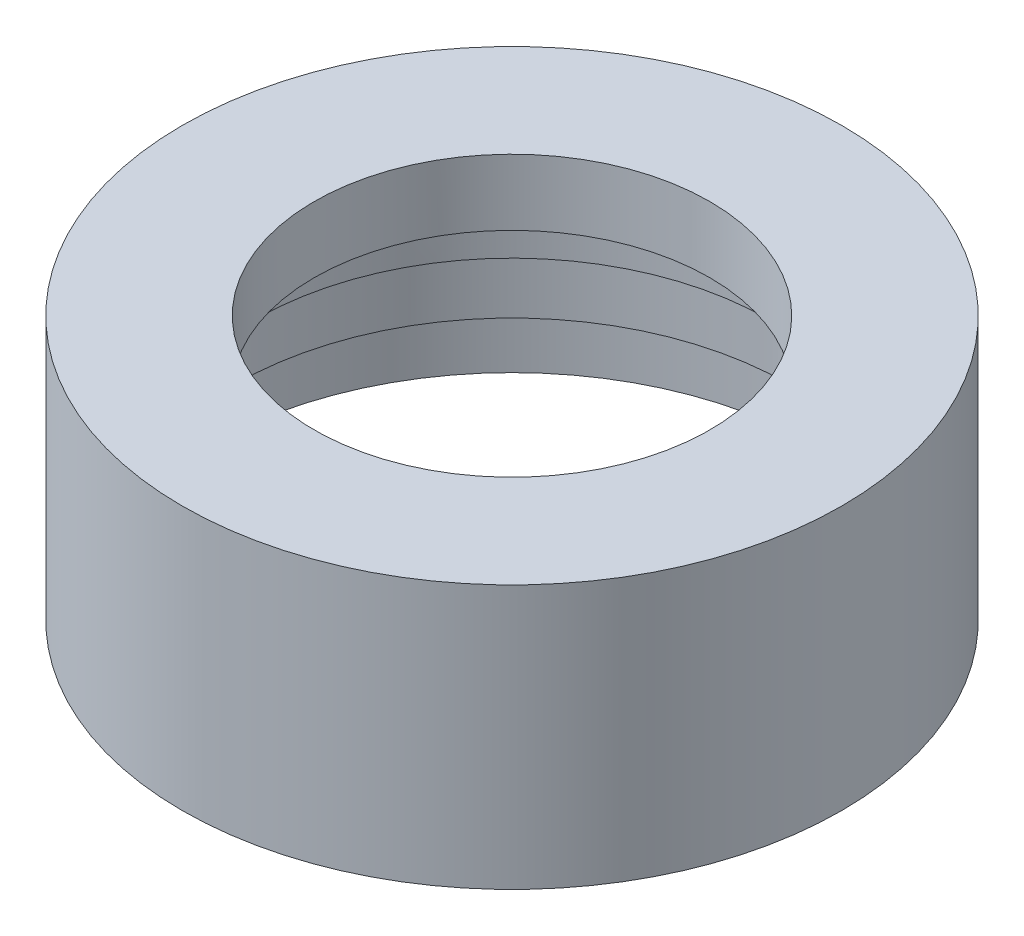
ISO-10303-21;
HEADER;
FILE_DESCRIPTION(('STEP AP214'),'2;1');
FILE_NAME('part.step','',(''),(''),'','','');
FILE_SCHEMA(('AUTOMOTIVE_DESIGN { 1 0 10303 214 1 1 1 1 }'));
ENDSEC;
DATA;
#1=APPLICATION_CONTEXT('core data for automotive mechanical design processes');
#2=APPLICATION_PROTOCOL_DEFINITION('international standard','automotive_design',2000,#1);
#3=PRODUCT_CONTEXT('',#1,'mechanical');
#4=PRODUCT('Part','Part','',(#3));
#5=PRODUCT_RELATED_PRODUCT_CATEGORY('part','',(#4));
#6=PRODUCT_DEFINITION_FORMATION('','',#4);
#7=PRODUCT_DEFINITION_CONTEXT('part definition',#1,'design');
#8=PRODUCT_DEFINITION('design','',#6,#7);
#9=PRODUCT_DEFINITION_SHAPE('','',#8);
#10=(LENGTH_UNIT() NAMED_UNIT(*) SI_UNIT(.MILLI.,.METRE.));
#11=(NAMED_UNIT(*) PLANE_ANGLE_UNIT() SI_UNIT($,.RADIAN.));
#12=(NAMED_UNIT(*) SI_UNIT($,.STERADIAN.) SOLID_ANGLE_UNIT());
#13=UNCERTAINTY_MEASURE_WITH_UNIT(LENGTH_MEASURE(1.E-05),#10,'distance_accuracy_value','');
#14=(GEOMETRIC_REPRESENTATION_CONTEXT(3) GLOBAL_UNCERTAINTY_ASSIGNED_CONTEXT((#13)) GLOBAL_UNIT_ASSIGNED_CONTEXT((#10,
#11,#12)) REPRESENTATION_CONTEXT('',''));
#15=CARTESIAN_POINT('',(0.,0.,0.));
#16=DIRECTION('',(0.,0.,1.));
#17=DIRECTION('',(1.,0.,0.));
#18=AXIS2_PLACEMENT_3D('',#15,#16,#17);
#19=CARTESIAN_POINT('',(-105.783467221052,-140.846893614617,0.));
#20=DIRECTION('',(0.,-1.,0.));
#21=DIRECTION('',(-1.00000000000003,0.,0.));
#22=AXIS2_PLACEMENT_3D('',#19,#20,#21);
#23=SPHERICAL_SURFACE('',#22,151.358167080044);
#24=CARTESIAN_POINT('',(-105.783467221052,8.48300497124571,0.));
#25=DIRECTION('',(0.,-1.,0.));
#26=DIRECTION('',(0.,0.,-1.00000000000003));
#27=AXIS2_PLACEMENT_3D('',#24,#25,#26);
#28=CIRCLE('',#27,24.6956702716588);
#29=CARTESIAN_POINT('',(-130.479137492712,8.48300497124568,0.));
#30=VERTEX_POINT('',#29);
#31=EDGE_CURVE('E68',#30,#30,#28,.T.);
#32=CARTESIAN_POINT('',(-105.783467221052,9.30766756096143,0.));
#33=DIRECTION('',(0.,-1.,0.));
#34=DIRECTION('',(0.,0.,-1.00000000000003));
#35=AXIS2_PLACEMENT_3D('',#32,#33,#34);
#36=CIRCLE('',#35,19.05);
#37=CARTESIAN_POINT('',(-124.833467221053,9.30766756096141,0.));
#38=VERTEX_POINT('',#37);
#39=EDGE_CURVE('E10',#38,#38,#36,.T.);
#40=CARTESIAN_POINT('',(-130.479137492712,8.48300497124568,0.));
#41=CARTESIAN_POINT('',(-130.420497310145,8.49270268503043,0.));
#42=CARTESIAN_POINT('',(-130.361851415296,8.50236585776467,0.));
#43=CARTESIAN_POINT('',(-130.24454828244,8.52162310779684,0.));
#44=CARTESIAN_POINT('',(-130.185891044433,8.53121718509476,0.));
#45=CARTESIAN_POINT('',(-130.068565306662,8.55033623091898,0.));
#46=CARTESIAN_POINT('',(-130.009896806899,8.55986119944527,0.));
#47=CARTESIAN_POINT('',(-129.892548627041,8.57884201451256,0.));
#48=CARTESIAN_POINT('',(-129.833868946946,8.58829786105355,0.));
#49=CARTESIAN_POINT('',(-129.716498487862,8.60714041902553,0.));
#50=CARTESIAN_POINT('',(-129.657807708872,8.61652713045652,0.));
#51=CARTESIAN_POINT('',(-129.540415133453,8.63523140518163,0.));
#52=CARTESIAN_POINT('',(-129.481713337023,8.64454896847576,0.));
#53=CARTESIAN_POINT('',(-129.36429880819,8.66311493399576,0.));
#54=CARTESIAN_POINT('',(-129.305586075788,8.67236333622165,0.));
#55=CARTESIAN_POINT('',(-129.188149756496,8.69079096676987,0.));
#56=CARTESIAN_POINT('',(-129.129426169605,8.6999701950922,0.));
#57=CARTESIAN_POINT('',(-129.011968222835,8.71825946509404,0.));
#58=CARTESIAN_POINT('',(-128.953233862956,8.72736950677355,0.));
#59=CARTESIAN_POINT('',(-128.835754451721,8.74552039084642,0.));
#60=CARTESIAN_POINT('',(-128.777009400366,8.7545612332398,0.));
#61=CARTESIAN_POINT('',(-128.65950868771,8.77257370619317,0.));
#62=CARTESIAN_POINT('',(-128.600753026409,8.78154533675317,0.));
#63=CARTESIAN_POINT('',(-128.483231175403,8.7994193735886,0.));
#64=CARTESIAN_POINT('',(-128.424464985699,8.80832177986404,0.));
#65=CARTESIAN_POINT('',(-128.306922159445,8.82605735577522,0.));
#66=CARTESIAN_POINT('',(-128.248145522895,8.83489052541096,0.));
#67=CARTESIAN_POINT('',(-128.130581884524,8.85248761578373,0.));
#68=CARTESIAN_POINT('',(-128.071794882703,8.86125153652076,0.));
#69=CARTESIAN_POINT('',(-127.954210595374,8.87871011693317,0.));
#70=CARTESIAN_POINT('',(-127.895413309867,8.88740477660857,0.));
#71=CARTESIAN_POINT('',(-127.777808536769,8.90472482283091,0.));
#72=CARTESIAN_POINT('',(-127.719001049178,8.91335020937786,0.));
#73=CARTESIAN_POINT('',(-127.601375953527,8.93053169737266,0.));
#74=CARTESIAN_POINT('',(-127.542558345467,8.93908779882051,0.));
#75=CARTESIAN_POINT('',(-127.424913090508,8.95613070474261,0.));
#76=CARTESIAN_POINT('',(-127.366085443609,8.96461750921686,0.));
#77=CARTESIAN_POINT('',(-127.248420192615,8.9815218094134,0.));
#78=CARTESIAN_POINT('',(-127.18958258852,8.9899393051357,0.));
#79=CARTESIAN_POINT('',(-127.071897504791,9.00670497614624,0.));
#80=CARTESIAN_POINT('',(-127.013050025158,9.01505315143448,0.));
#81=CARTESIAN_POINT('',(-126.895345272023,9.03168016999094,0.));
#82=CARTESIAN_POINT('',(-126.836487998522,9.03995901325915,0.));
#83=CARTESIAN_POINT('',(-126.718763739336,9.05644735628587,0.));
#84=CARTESIAN_POINT('',(-126.659896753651,9.06465685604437,0.));
#85=CARTESIAN_POINT('',(-126.542153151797,9.08100650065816,0.));
#86=CARTESIAN_POINT('',(-126.483276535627,9.08914664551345,0.));
#87=CARTESIAN_POINT('',(-126.365513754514,9.1053575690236,0.));
#88=CARTESIAN_POINT('',(-126.30662758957,9.11342834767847,0.));
#89=CARTESIAN_POINT('',(-126.188845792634,9.12950052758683,0.));
#90=CARTESIAN_POINT('',(-126.129950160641,9.13750192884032,0.));
#91=CARTESIAN_POINT('',(-126.012149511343,9.15343534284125,0.));
#92=CARTESIAN_POINT('',(-125.953244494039,9.16136735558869,0.));
#93=CARTESIAN_POINT('',(-125.835425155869,9.17716198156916,0.));
#94=CARTESIAN_POINT('',(-125.776510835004,9.18502459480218,0.));
#95=CARTESIAN_POINT('',(-125.658672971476,9.20068041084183,0.));
#96=CARTESIAN_POINT('',(-125.599749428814,9.20847361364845,0.));
#97=CARTESIAN_POINT('',(-125.481893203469,9.22399059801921,0.));
#98=CARTESIAN_POINT('',(-125.422960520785,9.23171437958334,0.));
#99=CARTESIAN_POINT('',(-125.305086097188,9.2470925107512,0.));
#100=CARTESIAN_POINT('',(-125.246144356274,9.25474686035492,0.));
#101=CARTESIAN_POINT('',(-125.128251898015,9.26998611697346,0.));
#102=CARTESIAN_POINT('',(-125.06930118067,9.27757102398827,0.));
#103=CARTESIAN_POINT('',(-124.951390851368,9.29267138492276,0.));
#104=CARTESIAN_POINT('',(-124.89243123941,9.30018683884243,0.));
#105=CARTESIAN_POINT('',(-124.833467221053,9.30766756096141,0.));
#106=B_SPLINE_CURVE_WITH_KNOTS('',3,(#40,#41,#42,#43,#44,#45,#46,#47,#48,#49,#50,#51,#52,#53,
#54,#55,#56,#57,#58,#59,#60,#61,#62,#63,#64,#65,#66,#67,#68,#69,#70,#71,#72,#73,#74,#75,#76,#77,
#78,#79,#80,#81,#82,#83,#84,#85,#86,#87,#88,#89,#90,#91,#92,#93,#94,#95,#96,#97,#98,#99,#100,
#101,#102,#103,#104,#105),.UNSPECIFIED.,.F.,.F.,(4,2,2,2,2,2,2,2,2,2,2,2,2,2,2,2,2,2,2,2,2,2,2,
2,2,2,2,2,2,2,2,2,4),(0.,0.1783099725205,0.356619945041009,0.534929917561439,0.713239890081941,
0.891549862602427,1.06985983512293,1.24816980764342,1.42647978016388,1.60478975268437,
1.78309972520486,1.96140969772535,2.13971967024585,2.31802964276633,2.49633961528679,
2.67464958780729,2.85295956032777,3.03126953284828,3.20957950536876,3.38788947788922,
3.5661994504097,3.74450942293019,3.9228193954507,4.10112936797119,4.27943934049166,
4.45774931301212,4.63605928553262,4.81436925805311,4.9926792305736,5.1709892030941,
5.34929917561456,5.52760914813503,5.70591912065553),.UNSPECIFIED.);
#107=EDGE_CURVE('BSEAM28',#30,#38,#106,.T.);
#108=ORIENTED_EDGE('',*,*,#31,.T.);
#109=ORIENTED_EDGE('',*,*,#39,.F.);
#110=ORIENTED_EDGE('',*,*,#107,.T.);
#111=ORIENTED_EDGE('',*,*,#107,.F.);
#112=EDGE_LOOP('',(#108,#110,#109,#111));
#113=FACE_BOUND('',#112,.T.);
#114=ADVANCED_FACE('F28',(#113),#23,.F.);
#115=CARTESIAN_POINT('',(-105.783467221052,-11.879759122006,0.));
#116=DIRECTION('',(0.,-1.,0.));
#117=DIRECTION('',(0.,0.,-1.00000000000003));
#118=AXIS2_PLACEMENT_3D('',#115,#116,#117);
#119=CYLINDRICAL_SURFACE('',#118,19.05);
#120=ORIENTED_EDGE('',*,*,#39,.T.);
#121=EDGE_LOOP('',(#120));
#122=FACE_BOUND('',#121,.T.);
#123=CARTESIAN_POINT('',(-105.783467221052,15.6576675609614,0.));
#124=DIRECTION('',(0.,-1.,0.));
#125=DIRECTION('',(0.,0.,-1.00000000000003));
#126=AXIS2_PLACEMENT_3D('',#123,#124,#125);
#127=CIRCLE('',#126,19.05);
#128=CARTESIAN_POINT('',(-105.783467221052,15.6576675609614,-19.0500000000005));
#129=VERTEX_POINT('',#128);
#130=EDGE_CURVE('E34',#129,#129,#127,.T.);
#131=ORIENTED_EDGE('',*,*,#130,.F.);
#132=EDGE_LOOP('',(#131));
#133=FACE_BOUND('',#132,.T.);
#134=ADVANCED_FACE('F92',(#122,#133),#119,.F.);
#135=CARTESIAN_POINT('',(-131.183467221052,15.6576675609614,1.17961196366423E-13));
#136=DIRECTION('',(0.,1.,0.));
#137=DIRECTION('',(0.,0.,1.00000000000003));
#138=AXIS2_PLACEMENT_3D('',#135,#136,#137);
#139=PLANE('',#138);
#140=ORIENTED_EDGE('',*,*,#130,.T.);
#141=EDGE_LOOP('',(#140));
#142=FACE_BOUND('',#141,.T.);
#143=CARTESIAN_POINT('',(-105.783467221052,15.6576675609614,0.));
#144=DIRECTION('',(0.,-1.,0.));
#145=DIRECTION('',(0.,0.,-1.00000000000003));
#146=AXIS2_PLACEMENT_3D('',#143,#144,#145);
#147=CIRCLE('',#146,31.75);
#148=CARTESIAN_POINT('',(-105.783467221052,15.6576675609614,-31.7500000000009));
#149=VERTEX_POINT('',#148);
#150=EDGE_CURVE('E38',#149,#149,#147,.T.);
#151=ORIENTED_EDGE('',*,*,#150,.F.);
#152=EDGE_LOOP('',(#151));
#153=FACE_BOUND('',#152,.T.);
#154=ADVANCED_FACE('F96',(#142,#153),#139,.T.);
#155=CARTESIAN_POINT('',(-105.783467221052,-11.879759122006,0.));
#156=DIRECTION('',(0.,-1.,0.));
#157=DIRECTION('',(0.,0.,-1.00000000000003));
#158=AXIS2_PLACEMENT_3D('',#155,#156,#157);
#159=CYLINDRICAL_SURFACE('',#158,31.75);
#160=ORIENTED_EDGE('',*,*,#150,.T.);
#161=EDGE_LOOP('',(#160));
#162=FACE_BOUND('',#161,.T.);
#163=CARTESIAN_POINT('',(-105.783467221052,-9.74233243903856,0.));
#164=DIRECTION('',(0.,-1.,0.));
#165=DIRECTION('',(0.,0.,-1.00000000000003));
#166=AXIS2_PLACEMENT_3D('',#163,#164,#165);
#167=CIRCLE('',#166,31.75);
#168=CARTESIAN_POINT('',(-105.783467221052,-9.74233243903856,-31.7500000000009));
#169=VERTEX_POINT('',#168);
#170=EDGE_CURVE('E42',#169,#169,#167,.T.);
#171=ORIENTED_EDGE('',*,*,#170,.F.);
#172=EDGE_LOOP('',(#171));
#173=FACE_BOUND('',#172,.T.);
#174=ADVANCED_FACE('F100',(#162,#173),#159,.T.);
#175=CARTESIAN_POINT('',(-131.183467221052,-9.74233243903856,1.17961196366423E-13));
#176=DIRECTION('',(0.,-1.,0.));
#177=DIRECTION('',(0.,0.,-1.00000000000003));
#178=AXIS2_PLACEMENT_3D('',#175,#176,#177);
#179=PLANE('',#178);
#180=ORIENTED_EDGE('',*,*,#170,.T.);
#181=EDGE_LOOP('',(#180));
#182=FACE_BOUND('',#181,.T.);
#183=CARTESIAN_POINT('',(-105.783467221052,-9.74233243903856,0.));
#184=DIRECTION('',(0.,-1.,0.));
#185=DIRECTION('',(0.,0.,-1.00000000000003));
#186=AXIS2_PLACEMENT_3D('',#183,#184,#185);
#187=CIRCLE('',#186,29.21);
#188=CARTESIAN_POINT('',(-105.783467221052,-9.74233243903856,-29.2100000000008));
#189=VERTEX_POINT('',#188);
#190=EDGE_CURVE('E47',#189,#189,#187,.T.);
#191=ORIENTED_EDGE('',*,*,#190,.F.);
#192=EDGE_LOOP('',(#191));
#193=FACE_BOUND('',#192,.T.);
#194=ADVANCED_FACE('F106',(#182,#193),#179,.T.);
#195=CARTESIAN_POINT('',(-105.783467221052,-11.879759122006,0.));
#196=DIRECTION('',(0.,-1.,0.));
#197=DIRECTION('',(0.,0.,-1.00000000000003));
#198=AXIS2_PLACEMENT_3D('',#195,#196,#197);
#199=CYLINDRICAL_SURFACE('',#198,29.21);
#200=CARTESIAN_POINT('',(-105.783467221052,-3.39233243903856,0.));
#201=DIRECTION('',(0.,-1.,0.));
#202=DIRECTION('',(0.,0.,-1.00000000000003));
#203=AXIS2_PLACEMENT_3D('',#200,#201,#202);
#204=CIRCLE('',#203,29.21);
#205=CARTESIAN_POINT('',(-105.783467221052,-3.39233243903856,-29.2100000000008));
#206=VERTEX_POINT('',#205);
#207=EDGE_CURVE('E50',#206,#206,#204,.T.);
#208=ORIENTED_EDGE('',*,*,#207,.F.);
#209=EDGE_LOOP('',(#208));
#210=FACE_BOUND('',#209,.T.);
#211=ORIENTED_EDGE('',*,*,#190,.T.);
#212=EDGE_LOOP('',(#211));
#213=FACE_BOUND('',#212,.T.);
#214=ADVANCED_FACE('F110',(#210,#213),#199,.F.);
#215=CARTESIAN_POINT('',(-131.183467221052,-3.39233243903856,1.17961196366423E-13));
#216=DIRECTION('',(0.,-1.,0.));
#217=DIRECTION('',(0.,0.,-1.00000000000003));
#218=AXIS2_PLACEMENT_3D('',#215,#216,#217);
#219=PLANE('',#218);
#220=ORIENTED_EDGE('',*,*,#207,.T.);
#221=EDGE_LOOP('',(#220));
#222=FACE_BOUND('',#221,.T.);
#223=CARTESIAN_POINT('',(-105.783467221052,-3.39233243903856,0.));
#224=DIRECTION('',(0.,-1.,0.));
#225=DIRECTION('',(0.,0.,-1.00000000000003));
#226=AXIS2_PLACEMENT_3D('',#223,#224,#225);
#227=CIRCLE('',#226,26.67);
#228=CARTESIAN_POINT('',(-105.783467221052,-3.39233243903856,-26.6700000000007));
#229=VERTEX_POINT('',#228);
#230=EDGE_CURVE('E53',#229,#229,#227,.T.);
#231=ORIENTED_EDGE('',*,*,#230,.F.);
#232=EDGE_LOOP('',(#231));
#233=FACE_BOUND('',#232,.T.);
#234=ADVANCED_FACE('F114',(#222,#233),#219,.T.);
#235=CARTESIAN_POINT('',(-105.783467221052,-11.879759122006,0.));
#236=DIRECTION('',(0.,-1.,0.));
#237=DIRECTION('',(0.,0.,-1.00000000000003));
#238=AXIS2_PLACEMENT_3D('',#235,#236,#237);
#239=CYLINDRICAL_SURFACE('',#238,26.67);
#240=ORIENTED_EDGE('',*,*,#230,.T.);
#241=EDGE_LOOP('',(#240));
#242=FACE_BOUND('',#241,.T.);
#243=CARTESIAN_POINT('',(-105.783467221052,2.95766756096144,0.));
#244=DIRECTION('',(0.,-1.,0.));
#245=DIRECTION('',(0.,0.,-1.00000000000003));
#246=AXIS2_PLACEMENT_3D('',#243,#244,#245);
#247=CIRCLE('',#246,26.67);
#248=CARTESIAN_POINT('',(-105.783467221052,2.95766756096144,-26.6700000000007));
#249=VERTEX_POINT('',#248);
#250=EDGE_CURVE('E56',#249,#249,#247,.T.);
#251=ORIENTED_EDGE('',*,*,#250,.F.);
#252=EDGE_LOOP('',(#251));
#253=FACE_BOUND('',#252,.T.);
#254=ADVANCED_FACE('F118',(#242,#253),#239,.F.);
#255=CARTESIAN_POINT('',(-131.183467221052,2.95766756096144,1.17961196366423E-13));
#256=DIRECTION('',(0.,-1.,0.));
#257=DIRECTION('',(0.,0.,-1.00000000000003));
#258=AXIS2_PLACEMENT_3D('',#255,#256,#257);
#259=PLANE('',#258);
#260=ORIENTED_EDGE('',*,*,#250,.T.);
#261=EDGE_LOOP('',(#260));
#262=FACE_BOUND('',#261,.T.);
#263=CARTESIAN_POINT('',(-105.783467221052,2.95766756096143,0.));
#264=DIRECTION('',(0.,-1.,0.));
#265=DIRECTION('',(0.,0.,-1.00000000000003));
#266=AXIS2_PLACEMENT_3D('',#263,#264,#265);
#267=CIRCLE('',#266,24.7518220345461);
#268=CARTESIAN_POINT('',(-105.783467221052,2.95766756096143,-24.7518220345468));
#269=VERTEX_POINT('',#268);
#270=EDGE_CURVE('E59',#269,#269,#267,.T.);
#271=ORIENTED_EDGE('',*,*,#270,.F.);
#272=EDGE_LOOP('',(#271));
#273=FACE_BOUND('',#272,.T.);
#274=ADVANCED_FACE('F88',(#262,#273),#259,.T.);
#275=CARTESIAN_POINT('',(-105.783467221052,2.95766756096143,0.));
#276=DIRECTION('',(0.,-1.,0.));
#277=DIRECTION('',(0.,0.,-1.00000000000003));
#278=AXIS2_PLACEMENT_3D('',#275,#276,#277);
#279=CONICAL_SURFACE('',#278,24.7518220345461,0.0101622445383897);
#280=CARTESIAN_POINT('',(-105.783467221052,8.48252371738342,0.));
#281=DIRECTION('',(0.,-1.,0.));
#282=DIRECTION('',(0.,0.,-1.00000000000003));
#283=AXIS2_PLACEMENT_3D('',#280,#281,#282);
#284=CIRCLE('',#283,24.6956751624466);
#285=CARTESIAN_POINT('',(-105.783467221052,8.48252371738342,-24.6956751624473));
#286=VERTEX_POINT('',#285);
#287=EDGE_CURVE('E62',#286,#286,#284,.T.);
#288=ORIENTED_EDGE('',*,*,#287,.F.);
#289=EDGE_LOOP('',(#288));
#290=FACE_BOUND('',#289,.T.);
#291=ORIENTED_EDGE('',*,*,#270,.T.);
#292=EDGE_LOOP('',(#291));
#293=FACE_BOUND('',#292,.T.);
#294=ADVANCED_FACE('F82',(#290,#293),#279,.F.);
#295=CARTESIAN_POINT('',(-105.783467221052,8.47887055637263,0.));
#296=DIRECTION('',(0.,-1.,0.));
#297=DIRECTION('',(0.,0.,-1.00000000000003));
#298=AXIS2_PLACEMENT_3D('',#295,#296,#297);
#299=CONICAL_SURFACE('',#298,24.720670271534,1.4256688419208);
#300=ORIENTED_EDGE('',*,*,#287,.T.);
#301=EDGE_LOOP('',(#300));
#302=FACE_BOUND('',#301,.T.);
#303=CARTESIAN_POINT('',(-105.783467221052,8.47887055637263,0.));
#304=DIRECTION('',(0.,-1.,0.));
#305=DIRECTION('',(0.,0.,-1.00000000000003));
#306=AXIS2_PLACEMENT_3D('',#303,#304,#305);
#307=CIRCLE('',#306,24.720670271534);
#308=CARTESIAN_POINT('',(-105.783467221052,8.47887055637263,-24.7206702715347));
#309=VERTEX_POINT('',#308);
#310=EDGE_CURVE('E65',#309,#309,#307,.T.);
#311=ORIENTED_EDGE('',*,*,#310,.F.);
#312=EDGE_LOOP('',(#311));
#313=FACE_BOUND('',#312,.T.);
#314=ADVANCED_FACE('F77',(#302,#313),#299,.T.);
#315=CARTESIAN_POINT('',(-105.783467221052,8.47887055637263,0.));
#316=DIRECTION('',(0.,-1.,0.));
#317=DIRECTION('',(0.,0.,-1.00000000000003));
#318=AXIS2_PLACEMENT_3D('',#315,#316,#317);
#319=CONICAL_SURFACE('',#318,24.720670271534,1.40690311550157);
#320=ORIENTED_EDGE('',*,*,#31,.F.);
#321=EDGE_LOOP('',(#320));
#322=FACE_BOUND('',#321,.T.);
#323=ORIENTED_EDGE('',*,*,#310,.T.);
#324=EDGE_LOOP('',(#323));
#325=FACE_BOUND('',#324,.T.);
#326=ADVANCED_FACE('F74',(#322,#325),#319,.F.);
#327=CLOSED_SHELL('',(#114,#134,#154,#174,#194,#214,#234,#254,#274,#294,#314,#326));
#328=MANIFOLD_SOLID_BREP('B2',#327);
#329=ADVANCED_BREP_SHAPE_REPRESENTATION('',(#18,#328),#14);
#330=SHAPE_DEFINITION_REPRESENTATION(#9,#329);
ENDSEC;
END-ISO-10303-21;
